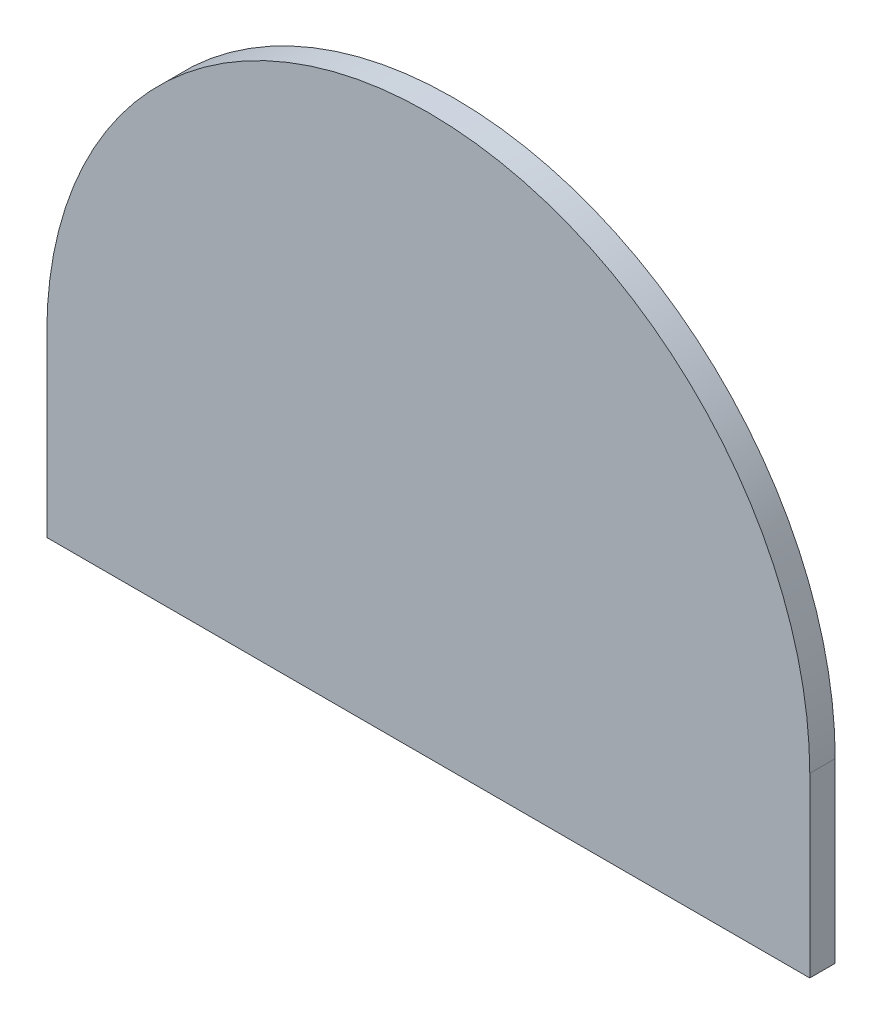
from build123d import *

# Parameters (mm, degrees)
BOSS_EXTRU_1_DEPTH = 15


with BuildPart() as part:
    # Esquisse1 → Boss.-Extru.1 (new body)
    with BuildSketch(Plane.XY):
        with BuildLine():
            ThreePointArc((-22.087777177, -39.249710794), (-41.3210228, 11.465752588), (-47.858747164, 65.310289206))
            Line((-47.858747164, 65.310289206), (-47.858747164, -39.249710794))
            Line((-47.858747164, -39.249710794), (-22.087777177, -39.249710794))
        make_face()
        with BuildLine():
            Line((402.141252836, 65.310289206), (-47.858747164, 65.310289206))
            ThreePointArc((-47.858747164, 65.310289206), (-41.3210228, 11.465752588), (-22.087777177, -39.249710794))
            Line((-22.087777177, -39.249710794), (376.37028285, -39.249710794))
            ThreePointArc((376.37028285, -39.249710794), (395.603528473, 11.465752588), (402.141252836, 65.310289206))
        make_face()
        with BuildLine():
            ThreePointArc((402.141252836, 65.310289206), (177.141252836, 290.310289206), (-47.858747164, 65.310289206))
            Line((-47.858747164, 65.310289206), (402.141252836, 65.310289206))
        make_face()
        with BuildLine():
            Line((402.141252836, -39.249710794), (402.141252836, 65.310289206))
            ThreePointArc((402.141252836, 65.310289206), (395.603528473, 11.465752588), (376.37028285, -39.249710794))
            Line((376.37028285, -39.249710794), (402.141252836, -39.249710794))
        make_face()
    extrude(amount=BOSS_EXTRU_1_DEPTH)


solid = part.part
